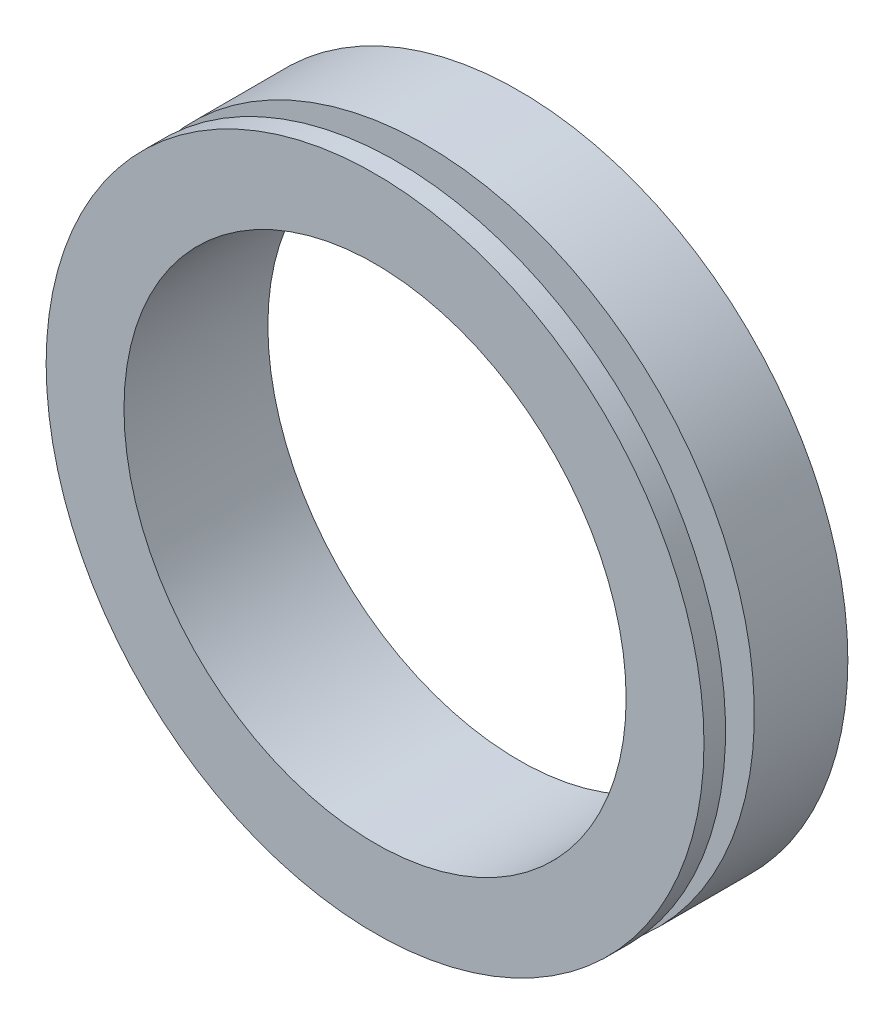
from build123d import *

# Parameters (mm, degrees)
SKETCH1_R           = 11.43
SKETCH1_R_2         = 8.7249
BOSS_EXTRUDE1_DEPTH = 5
SKETCH2_W           = 1.5
SKETCH2_H           = 1


with BuildPart() as part:
    # Sketch1 → Boss-Extrude1 (new body)
    with BuildSketch(Plane.XY):
        Circle(SKETCH1_R)
        Circle(SKETCH1_R_2, mode=Mode.SUBTRACT)
    extrude(amount=BOSS_EXTRUDE1_DEPTH)

    # Sketch2 → Cut-Revolve1 (revolve, cut)
    with BuildSketch(Plane(origin=(0, 0, 0), x_dir=(1, 0, 0), z_dir=(0, 1, 0)), mode=Mode.PRIVATE) as cut_revolve1_sk:
        with Locations((10.68, -3.75)):
            Rectangle(SKETCH2_W, SKETCH2_H)
    revolve(cut_revolve1_sk.sketch.rotate(Axis((0, 0, -2.189777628), (0, 0, 1)), 180), axis=Axis((0, 0, -2.189777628), (0, 0, 1)), mode=Mode.SUBTRACT)


solid = part.part
